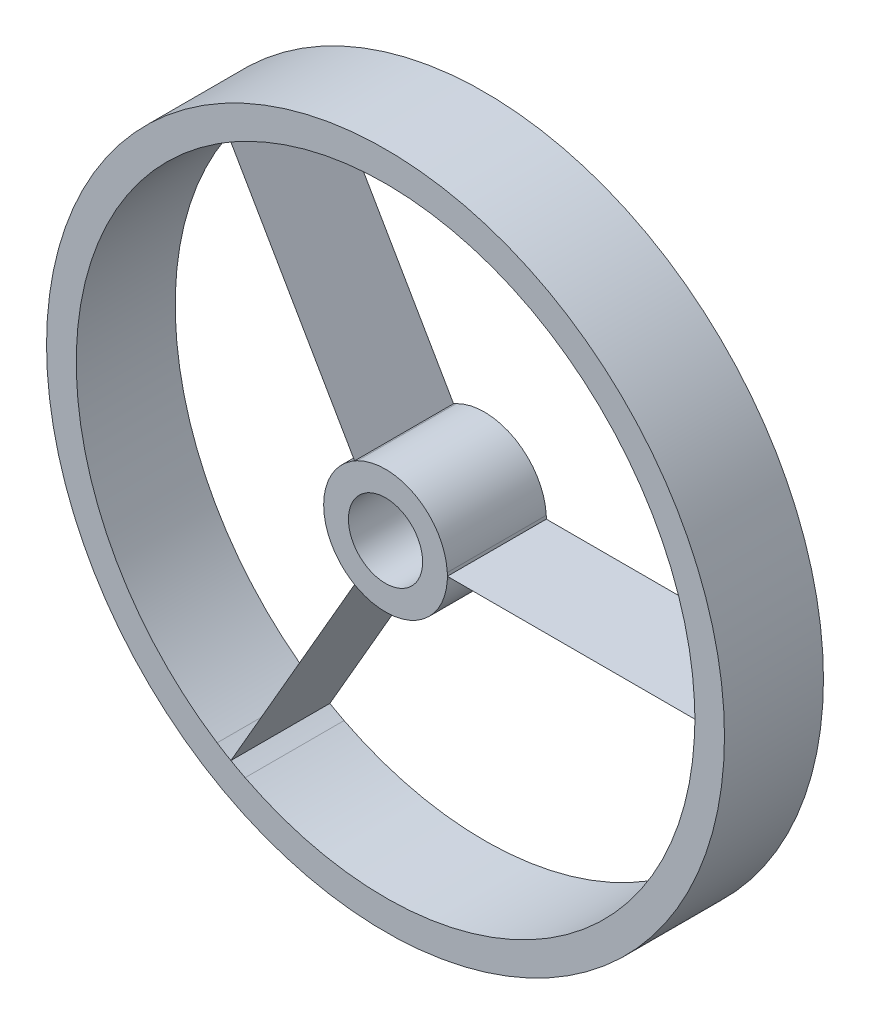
ISO-10303-21;
HEADER;
FILE_DESCRIPTION(('STEP AP214'),'2;1');
FILE_NAME('part.step','',(''),(''),'','','');
FILE_SCHEMA(('AUTOMOTIVE_DESIGN { 1 0 10303 214 1 1 1 1 }'));
ENDSEC;
DATA;
#1=APPLICATION_CONTEXT('core data for automotive mechanical design processes');
#2=APPLICATION_PROTOCOL_DEFINITION('international standard','automotive_design',2000,#1);
#3=PRODUCT_CONTEXT('',#1,'mechanical');
#4=PRODUCT('Part','Part','',(#3));
#5=PRODUCT_RELATED_PRODUCT_CATEGORY('part','',(#4));
#6=PRODUCT_DEFINITION_FORMATION('','',#4);
#7=PRODUCT_DEFINITION_CONTEXT('part definition',#1,'design');
#8=PRODUCT_DEFINITION('design','',#6,#7);
#9=PRODUCT_DEFINITION_SHAPE('','',#8);
#10=(LENGTH_UNIT() NAMED_UNIT(*) SI_UNIT(.MILLI.,.METRE.));
#11=(NAMED_UNIT(*) PLANE_ANGLE_UNIT() SI_UNIT($,.RADIAN.));
#12=(NAMED_UNIT(*) SI_UNIT($,.STERADIAN.) SOLID_ANGLE_UNIT());
#13=UNCERTAINTY_MEASURE_WITH_UNIT(LENGTH_MEASURE(1.E-05),#10,'distance_accuracy_value','');
#14=(GEOMETRIC_REPRESENTATION_CONTEXT(3) GLOBAL_UNCERTAINTY_ASSIGNED_CONTEXT((#13)) GLOBAL_UNIT_ASSIGNED_CONTEXT((#10,
#11,#12)) REPRESENTATION_CONTEXT('',''));
#15=CARTESIAN_POINT('',(0.,0.,0.));
#16=DIRECTION('',(0.,0.,1.));
#17=DIRECTION('',(1.,0.,0.));
#18=AXIS2_PLACEMENT_3D('',#15,#16,#17);
#19=CARTESIAN_POINT('',(-12.5000000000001,-21.6506350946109,40.));
#20=DIRECTION('',(0.866025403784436,-0.500000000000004,0.));
#21=DIRECTION('',(0.500000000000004,0.866025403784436,0.));
#22=AXIS2_PLACEMENT_3D('',#19,#20,#21);
#23=PLANE('',#22);
#24=DIRECTION('',(0.500000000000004,0.866025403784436,0.));
#25=VECTOR('',#24,1.);
#26=CARTESIAN_POINT('',(-12.5000000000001,-21.6506350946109,40.));
#27=LINE('',#26,#25);
#28=CARTESIAN_POINT('',(-62.5000000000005,-108.253175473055,40.));
#29=VERTEX_POINT('',#28);
#30=CARTESIAN_POINT('',(-12.5000000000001,-21.6506350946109,40.));
#31=VERTEX_POINT('',#30);
#32=EDGE_CURVE('E60',#29,#31,#27,.T.);
#33=ORIENTED_EDGE('',*,*,#32,.F.);
#34=DIRECTION('',(0.,0.,-1.));
#35=VECTOR('',#34,1.);
#36=CARTESIAN_POINT('',(-62.5000000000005,-108.253175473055,40.));
#37=LINE('',#36,#35);
#38=CARTESIAN_POINT('',(-62.5000000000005,-108.253175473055,0.));
#39=VERTEX_POINT('',#38);
#40=EDGE_CURVE('E13',#29,#39,#37,.T.);
#41=ORIENTED_EDGE('',*,*,#40,.T.);
#42=DIRECTION('',(0.500000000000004,0.866025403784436,0.));
#43=VECTOR('',#42,1.);
#44=CARTESIAN_POINT('',(-12.5000000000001,-21.6506350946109,0.));
#45=LINE('',#44,#43);
#46=CARTESIAN_POINT('',(-12.5000000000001,-21.6506350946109,0.));
#47=VERTEX_POINT('',#46);
#48=EDGE_CURVE('E75',#39,#47,#45,.T.);
#49=ORIENTED_EDGE('',*,*,#48,.T.);
#50=DIRECTION('',(0.,0.,1.));
#51=VECTOR('',#50,1.);
#52=CARTESIAN_POINT('',(-12.5000000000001,-21.6506350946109,40.));
#53=LINE('',#52,#51);
#54=EDGE_CURVE('E70',#47,#31,#53,.T.);
#55=ORIENTED_EDGE('',*,*,#54,.T.);
#56=EDGE_LOOP('',(#33,#41,#49,#55));
#57=FACE_BOUND('',#56,.T.);
#58=ADVANCED_FACE('F55',(#57),#23,.T.);
#59=OPEN_SHELL('',(#58));
#60=SHELL_BASED_SURFACE_MODEL('B2',(#59));
#61=CARTESIAN_POINT('',(25.,0.,40.));
#62=DIRECTION('',(0.,1.,0.));
#63=DIRECTION('',(0.,0.,1.));
#64=AXIS2_PLACEMENT_3D('',#61,#62,#63);
#65=PLANE('',#64);
#66=DIRECTION('',(0.,0.,1.));
#67=VECTOR('',#66,1.);
#68=CARTESIAN_POINT('',(25.,0.,40.));
#69=LINE('',#68,#67);
#70=CARTESIAN_POINT('',(25.,0.,0.));
#71=VERTEX_POINT('',#70);
#72=CARTESIAN_POINT('',(25.,0.,40.));
#73=VERTEX_POINT('',#72);
#74=EDGE_CURVE('E53',#71,#73,#69,.T.);
#75=ORIENTED_EDGE('',*,*,#74,.F.);
#76=DIRECTION('',(-1.,0.,0.));
#77=VECTOR('',#76,1.);
#78=CARTESIAN_POINT('',(25.,0.,0.));
#79=LINE('',#78,#77);
#80=CARTESIAN_POINT('',(125.,0.,0.));
#81=VERTEX_POINT('',#80);
#82=EDGE_CURVE('E139',#81,#71,#79,.T.);
#83=ORIENTED_EDGE('',*,*,#82,.F.);
#84=DIRECTION('',(0.,0.,-1.));
#85=VECTOR('',#84,1.);
#86=CARTESIAN_POINT('',(125.,0.,40.));
#87=LINE('',#86,#85);
#88=CARTESIAN_POINT('',(125.,0.,40.));
#89=VERTEX_POINT('',#88);
#90=EDGE_CURVE('E134',#89,#81,#87,.T.);
#91=ORIENTED_EDGE('',*,*,#90,.F.);
#92=DIRECTION('',(-1.,0.,0.));
#93=VECTOR('',#92,1.);
#94=CARTESIAN_POINT('',(25.,0.,40.));
#95=LINE('',#94,#93);
#96=EDGE_CURVE('E124',#89,#73,#95,.T.);
#97=ORIENTED_EDGE('',*,*,#96,.T.);
#98=EDGE_LOOP('',(#75,#83,#91,#97));
#99=FACE_BOUND('',#98,.T.);
#100=ADVANCED_FACE('F119',(#99),#65,.F.);
#101=OPEN_SHELL('',(#100));
#102=SHELL_BASED_SURFACE_MODEL('B7',(#101));
#103=CARTESIAN_POINT('',(-12.5000000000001,21.6506350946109,40.));
#104=DIRECTION('',(-0.866025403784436,-0.500000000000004,0.));
#105=DIRECTION('',(0.500000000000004,-0.866025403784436,0.));
#106=AXIS2_PLACEMENT_3D('',#103,#104,#105);
#107=PLANE('',#106);
#108=DIRECTION('',(0.,0.,1.));
#109=VECTOR('',#108,1.);
#110=CARTESIAN_POINT('',(-12.5000000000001,21.6506350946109,40.));
#111=LINE('',#110,#109);
#112=CARTESIAN_POINT('',(-12.5000000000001,21.6506350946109,0.));
#113=VERTEX_POINT('',#112);
#114=CARTESIAN_POINT('',(-12.5000000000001,21.6506350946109,40.));
#115=VERTEX_POINT('',#114);
#116=EDGE_CURVE('E117',#113,#115,#111,.T.);
#117=ORIENTED_EDGE('',*,*,#116,.F.);
#118=DIRECTION('',(0.500000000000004,-0.866025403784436,0.));
#119=VECTOR('',#118,1.);
#120=CARTESIAN_POINT('',(-12.5000000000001,21.6506350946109,0.));
#121=LINE('',#120,#119);
#122=CARTESIAN_POINT('',(-62.5000000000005,108.253175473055,0.));
#123=VERTEX_POINT('',#122);
#124=EDGE_CURVE('E203',#123,#113,#121,.T.);
#125=ORIENTED_EDGE('',*,*,#124,.F.);
#126=DIRECTION('',(0.,0.,-1.));
#127=VECTOR('',#126,1.);
#128=CARTESIAN_POINT('',(-62.5000000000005,108.253175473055,40.));
#129=LINE('',#128,#127);
#130=CARTESIAN_POINT('',(-62.5000000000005,108.253175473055,40.));
#131=VERTEX_POINT('',#130);
#132=EDGE_CURVE('E198',#131,#123,#129,.T.);
#133=ORIENTED_EDGE('',*,*,#132,.F.);
#134=DIRECTION('',(0.500000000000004,-0.866025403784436,0.));
#135=VECTOR('',#134,1.);
#136=CARTESIAN_POINT('',(-12.5000000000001,21.6506350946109,40.));
#137=LINE('',#136,#135);
#138=EDGE_CURVE('E188',#131,#115,#137,.T.);
#139=ORIENTED_EDGE('',*,*,#138,.T.);
#140=EDGE_LOOP('',(#117,#125,#133,#139));
#141=FACE_BOUND('',#140,.T.);
#142=ADVANCED_FACE('F183',(#141),#107,.F.);
#143=OPEN_SHELL('',(#142));
#144=SHELL_BASED_SURFACE_MODEL('B47',(#143));
#145=CARTESIAN_POINT('',(0.,0.,40.));
#146=DIRECTION('',(0.,0.,-1.));
#147=DIRECTION('',(-1.,0.,0.));
#148=AXIS2_PLACEMENT_3D('',#145,#146,#147);
#149=CYLINDRICAL_SURFACE('',#148,125.);
#150=CARTESIAN_POINT('',(0.,0.,0.));
#151=DIRECTION('',(0.,0.,1.));
#152=DIRECTION('',(1.,0.,0.));
#153=AXIS2_PLACEMENT_3D('',#150,#151,#152);
#154=CIRCLE('',#153,125.);
#155=CARTESIAN_POINT('',(-56.7488124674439,111.375815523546,0.));
#156=VERTEX_POINT('',#155);
#157=CARTESIAN_POINT('',(-68.0798793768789,104.833820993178,0.));
#158=VERTEX_POINT('',#157);
#159=EDGE_CURVE('E319',#156,#158,#154,.T.);
#160=ORIENTED_EDGE('',*,*,#159,.F.);
#161=DIRECTION('',(0.,0.,-1.));
#162=VECTOR('',#161,1.);
#163=CARTESIAN_POINT('',(-56.7488124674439,111.375815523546,40.));
#164=LINE('',#163,#162);
#165=CARTESIAN_POINT('',(-56.7488124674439,111.375815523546,40.));
#166=VERTEX_POINT('',#165);
#167=EDGE_CURVE('E181',#156,#166,#164,.F.);
#168=ORIENTED_EDGE('',*,*,#167,.T.);
#169=CARTESIAN_POINT('',(0.,0.,40.));
#170=DIRECTION('',(0.,0.,1.));
#171=DIRECTION('',(1.,0.,0.));
#172=AXIS2_PLACEMENT_3D('',#169,#170,#171);
#173=CIRCLE('',#172,125.);
#174=CARTESIAN_POINT('',(-68.0798793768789,104.833820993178,40.));
#175=VERTEX_POINT('',#174);
#176=EDGE_CURVE('E312',#166,#175,#173,.T.);
#177=ORIENTED_EDGE('',*,*,#176,.T.);
#178=DIRECTION('',(0.,0.,-1.));
#179=VECTOR('',#178,1.);
#180=CARTESIAN_POINT('',(-68.0798793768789,104.833820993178,40.));
#181=LINE('',#180,#179);
#182=EDGE_CURVE('E244',#175,#158,#181,.T.);
#183=ORIENTED_EDGE('',*,*,#182,.T.);
#184=EDGE_LOOP('',(#160,#168,#177,#183));
#185=FACE_BOUND('',#184,.T.);
#186=ADVANCED_FACE('F235',(#185),#149,.F.);
#187=ORIENTED_EDGE('',*,*,#167,.F.);
#188=CARTESIAN_POINT('',(124.828691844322,6.54199453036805,0.));
#189=VERTEX_POINT('',#188);
#190=EDGE_CURVE('E295',#189,#156,#154,.T.);
#191=ORIENTED_EDGE('',*,*,#190,.F.);
#192=DIRECTION('',(0.,0.,-1.));
#193=VECTOR('',#192,1.);
#194=CARTESIAN_POINT('',(124.828691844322,6.54199453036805,40.));
#195=LINE('',#194,#193);
#196=CARTESIAN_POINT('',(124.828691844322,6.54199453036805,40.));
#197=VERTEX_POINT('',#196);
#198=EDGE_CURVE('E289',#197,#189,#195,.T.);
#199=ORIENTED_EDGE('',*,*,#198,.F.);
#200=EDGE_CURVE('E293',#197,#166,#173,.T.);
#201=ORIENTED_EDGE('',*,*,#200,.T.);
#202=EDGE_LOOP('',(#187,#191,#199,#201));
#203=FACE_BOUND('',#202,.T.);
#204=ADVANCED_FACE('F291',(#203),#149,.F.);
#205=CARTESIAN_POINT('',(-68.0798793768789,-104.833820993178,0.));
#206=VERTEX_POINT('',#205);
#207=CARTESIAN_POINT('',(-56.7488124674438,-111.375815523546,0.));
#208=VERTEX_POINT('',#207);
#209=EDGE_CURVE('E343',#206,#208,#154,.T.);
#210=ORIENTED_EDGE('',*,*,#209,.F.);
#211=DIRECTION('',(0.,0.,-1.));
#212=VECTOR('',#211,1.);
#213=CARTESIAN_POINT('',(-68.0798793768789,-104.833820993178,40.));
#214=LINE('',#213,#212);
#215=CARTESIAN_POINT('',(-68.0798793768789,-104.833820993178,40.));
#216=VERTEX_POINT('',#215);
#217=EDGE_CURVE('E327',#206,#216,#214,.F.);
#218=ORIENTED_EDGE('',*,*,#217,.T.);
#219=CARTESIAN_POINT('',(-56.7488124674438,-111.375815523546,40.));
#220=VERTEX_POINT('',#219);
#221=EDGE_CURVE('E349',#216,#220,#173,.T.);
#222=ORIENTED_EDGE('',*,*,#221,.T.);
#223=DIRECTION('',(0.,0.,-1.));
#224=VECTOR('',#223,1.);
#225=CARTESIAN_POINT('',(-56.7488124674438,-111.375815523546,40.));
#226=LINE('',#225,#224);
#227=EDGE_CURVE('E259',#220,#208,#226,.T.);
#228=ORIENTED_EDGE('',*,*,#227,.T.);
#229=EDGE_LOOP('',(#210,#218,#222,#228));
#230=FACE_BOUND('',#229,.T.);
#231=ADVANCED_FACE('F347',(#230),#149,.F.);
#232=ORIENTED_EDGE('',*,*,#182,.F.);
#233=EDGE_CURVE('E316',#175,#216,#173,.T.);
#234=ORIENTED_EDGE('',*,*,#233,.T.);
#235=ORIENTED_EDGE('',*,*,#217,.F.);
#236=EDGE_CURVE('E339',#158,#206,#154,.T.);
#237=ORIENTED_EDGE('',*,*,#236,.F.);
#238=EDGE_LOOP('',(#232,#234,#235,#237));
#239=FACE_BOUND('',#238,.T.);
#240=ADVANCED_FACE('F340',(#239),#149,.F.);
#241=CARTESIAN_POINT('',(124.828691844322,-6.541994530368,0.));
#242=VERTEX_POINT('',#241);
#243=EDGE_CURVE('E320',#242,#189,#154,.T.);
#244=ORIENTED_EDGE('',*,*,#243,.F.);
#245=DIRECTION('',(0.,0.,-1.));
#246=VECTOR('',#245,1.);
#247=CARTESIAN_POINT('',(124.828691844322,-6.541994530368,40.));
#248=LINE('',#247,#246);
#249=CARTESIAN_POINT('',(124.828691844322,-6.541994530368,40.));
#250=VERTEX_POINT('',#249);
#251=EDGE_CURVE('E251',#242,#250,#248,.F.);
#252=ORIENTED_EDGE('',*,*,#251,.T.);
#253=EDGE_CURVE('E302',#250,#197,#173,.T.);
#254=ORIENTED_EDGE('',*,*,#253,.T.);
#255=ORIENTED_EDGE('',*,*,#198,.T.);
#256=EDGE_LOOP('',(#244,#252,#254,#255));
#257=FACE_BOUND('',#256,.T.);
#258=ADVANCED_FACE('F303',(#257),#149,.F.);
#259=CARTESIAN_POINT('',(0.,0.,40.));
#260=DIRECTION('',(0.,0.,1.));
#261=DIRECTION('',(1.,0.,0.));
#262=AXIS2_PLACEMENT_3D('',#259,#260,#261);
#263=PLANE('',#262);
#264=CARTESIAN_POINT('',(0.,0.,40.));
#265=DIRECTION('',(0.,0.,1.));
#266=DIRECTION('',(1.,0.,0.));
#267=AXIS2_PLACEMENT_3D('',#264,#265,#266);
#268=CIRCLE('',#267,137.);
#269=CARTESIAN_POINT('',(137.,0.,40.));
#270=VERTEX_POINT('',#269);
#271=EDGE_CURVE('E299',#270,#270,#268,.T.);
#272=ORIENTED_EDGE('',*,*,#271,.T.);
#273=EDGE_LOOP('',(#272));
#274=FACE_BOUND('',#273,.T.);
#275=ORIENTED_EDGE('',*,*,#200,.F.);
#276=ORIENTED_EDGE('',*,*,#253,.F.);
#277=EDGE_CURVE('E306',#220,#250,#173,.T.);
#278=ORIENTED_EDGE('',*,*,#277,.F.);
#279=ORIENTED_EDGE('',*,*,#221,.F.);
#280=ORIENTED_EDGE('',*,*,#233,.F.);
#281=ORIENTED_EDGE('',*,*,#176,.F.);
#282=EDGE_LOOP('',(#275,#276,#278,#279,#280,#281));
#283=FACE_BOUND('',#282,.T.);
#284=ADVANCED_FACE('F309',(#274,#283),#263,.T.);
#285=CARTESIAN_POINT('',(0.,0.,0.));
#286=DIRECTION('',(0.,0.,1.));
#287=DIRECTION('',(1.,0.,0.));
#288=AXIS2_PLACEMENT_3D('',#285,#286,#287);
#289=PLANE('',#288);
#290=CARTESIAN_POINT('',(0.,0.,0.));
#291=DIRECTION('',(0.,0.,1.));
#292=DIRECTION('',(1.,0.,0.));
#293=AXIS2_PLACEMENT_3D('',#290,#291,#292);
#294=CIRCLE('',#293,137.);
#295=CARTESIAN_POINT('',(137.,0.,0.));
#296=VERTEX_POINT('',#295);
#297=EDGE_CURVE('E313',#296,#296,#294,.T.);
#298=ORIENTED_EDGE('',*,*,#297,.F.);
#299=EDGE_LOOP('',(#298));
#300=FACE_BOUND('',#299,.T.);
#301=ORIENTED_EDGE('',*,*,#190,.T.);
#302=ORIENTED_EDGE('',*,*,#159,.T.);
#303=ORIENTED_EDGE('',*,*,#236,.T.);
#304=ORIENTED_EDGE('',*,*,#209,.T.);
#305=EDGE_CURVE('E346',#208,#242,#154,.T.);
#306=ORIENTED_EDGE('',*,*,#305,.T.);
#307=ORIENTED_EDGE('',*,*,#243,.T.);
#308=EDGE_LOOP('',(#301,#302,#303,#304,#306,#307));
#309=FACE_BOUND('',#308,.T.);
#310=ADVANCED_FACE('F344',(#300,#309),#289,.F.);
#311=CARTESIAN_POINT('',(0.,0.,40.));
#312=DIRECTION('',(0.,0.,-1.));
#313=DIRECTION('',(-1.,0.,0.));
#314=AXIS2_PLACEMENT_3D('',#311,#312,#313);
#315=CYLINDRICAL_SURFACE('',#314,137.);
#316=ORIENTED_EDGE('',*,*,#271,.F.);
#317=EDGE_LOOP('',(#316));
#318=FACE_BOUND('',#317,.T.);
#319=ORIENTED_EDGE('',*,*,#297,.T.);
#320=EDGE_LOOP('',(#319));
#321=FACE_BOUND('',#320,.T.);
#322=ADVANCED_FACE('F237',(#318,#321),#315,.T.);
#323=ORIENTED_EDGE('',*,*,#227,.F.);
#324=ORIENTED_EDGE('',*,*,#277,.T.);
#325=ORIENTED_EDGE('',*,*,#251,.F.);
#326=ORIENTED_EDGE('',*,*,#305,.F.);
#327=EDGE_LOOP('',(#323,#324,#325,#326));
#328=FACE_BOUND('',#327,.T.);
#329=ADVANCED_FACE('F350',(#328),#149,.F.);
#330=CLOSED_SHELL('',(#186,#204,#231,#240,#258,#284,#310,#322,#329));
#331=MANIFOLD_SOLID_BREP('B111',#330);
#332=CARTESIAN_POINT('',(0.,0.,40.));
#333=DIRECTION('',(0.,0.,-1.));
#334=DIRECTION('',(-1.,0.,0.));
#335=AXIS2_PLACEMENT_3D('',#332,#333,#334);
#336=CYLINDRICAL_SURFACE('',#335,25.);
#337=DIRECTION('',(0.,0.,-1.));
#338=VECTOR('',#337,1.);
#339=CARTESIAN_POINT('',(-11.3497624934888,22.2751631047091,40.));
#340=LINE('',#339,#338);
#341=CARTESIAN_POINT('',(-11.3497624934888,22.2751631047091,0.));
#342=VERTEX_POINT('',#341);
#343=CARTESIAN_POINT('',(-11.3497624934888,22.2751631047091,40.));
#344=VERTEX_POINT('',#343);
#345=EDGE_CURVE('E233',#342,#344,#340,.F.);
#346=ORIENTED_EDGE('',*,*,#345,.F.);
#347=CARTESIAN_POINT('',(0.,0.,0.));
#348=DIRECTION('',(0.,0.,1.));
#349=DIRECTION('',(1.,0.,0.));
#350=AXIS2_PLACEMENT_3D('',#347,#348,#349);
#351=CIRCLE('',#350,25.);
#352=CARTESIAN_POINT('',(-13.6159758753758,20.9667641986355,0.));
#353=VERTEX_POINT('',#352);
#354=EDGE_CURVE('E515',#342,#353,#351,.T.);
#355=ORIENTED_EDGE('',*,*,#354,.T.);
#356=DIRECTION('',(0.,0.,-1.));
#357=VECTOR('',#356,1.);
#358=CARTESIAN_POINT('',(-13.6159758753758,20.9667641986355,40.));
#359=LINE('',#358,#357);
#360=CARTESIAN_POINT('',(-13.6159758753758,20.9667641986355,40.));
#361=VERTEX_POINT('',#360);
#362=EDGE_CURVE('E443',#361,#353,#359,.T.);
#363=ORIENTED_EDGE('',*,*,#362,.F.);
#364=CARTESIAN_POINT('',(0.,0.,40.));
#365=DIRECTION('',(0.,0.,1.));
#366=DIRECTION('',(1.,0.,0.));
#367=AXIS2_PLACEMENT_3D('',#364,#365,#366);
#368=CIRCLE('',#367,25.);
#369=EDGE_CURVE('E509',#344,#361,#368,.T.);
#370=ORIENTED_EDGE('',*,*,#369,.F.);
#371=EDGE_LOOP('',(#346,#355,#363,#370));
#372=FACE_BOUND('',#371,.T.);
#373=ADVANCED_FACE('F434',(#372),#336,.T.);
#374=CARTESIAN_POINT('',(24.9657383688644,1.30839890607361,0.));
#375=VERTEX_POINT('',#374);
#376=EDGE_CURVE('E505',#375,#342,#351,.T.);
#377=ORIENTED_EDGE('',*,*,#376,.T.);
#378=ORIENTED_EDGE('',*,*,#345,.T.);
#379=CARTESIAN_POINT('',(24.9657383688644,1.30839890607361,40.));
#380=VERTEX_POINT('',#379);
#381=EDGE_CURVE('E497',#380,#344,#368,.T.);
#382=ORIENTED_EDGE('',*,*,#381,.F.);
#383=DIRECTION('',(0.,0.,-1.));
#384=VECTOR('',#383,1.);
#385=CARTESIAN_POINT('',(24.9657383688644,1.30839890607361,40.));
#386=LINE('',#385,#384);
#387=EDGE_CURVE('E486',#380,#375,#386,.T.);
#388=ORIENTED_EDGE('',*,*,#387,.T.);
#389=EDGE_LOOP('',(#377,#378,#382,#388));
#390=FACE_BOUND('',#389,.T.);
#391=ADVANCED_FACE('F507',(#390),#336,.T.);
#392=DIRECTION('',(0.,0.,-1.));
#393=VECTOR('',#392,1.);
#394=CARTESIAN_POINT('',(-13.6159758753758,-20.9667641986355,40.));
#395=LINE('',#394,#393);
#396=CARTESIAN_POINT('',(-13.6159758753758,-20.9667641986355,0.));
#397=VERTEX_POINT('',#396);
#398=CARTESIAN_POINT('',(-13.6159758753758,-20.9667641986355,40.));
#399=VERTEX_POINT('',#398);
#400=EDGE_CURVE('E521',#397,#399,#395,.F.);
#401=ORIENTED_EDGE('',*,*,#400,.F.);
#402=CARTESIAN_POINT('',(-11.3497624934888,-22.2751631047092,0.));
#403=VERTEX_POINT('',#402);
#404=EDGE_CURVE('E540',#397,#403,#351,.T.);
#405=ORIENTED_EDGE('',*,*,#404,.T.);
#406=DIRECTION('',(0.,0.,-1.));
#407=VECTOR('',#406,1.);
#408=CARTESIAN_POINT('',(-11.3497624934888,-22.2751631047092,40.));
#409=LINE('',#408,#407);
#410=CARTESIAN_POINT('',(-11.3497624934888,-22.2751631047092,40.));
#411=VERTEX_POINT('',#410);
#412=EDGE_CURVE('E458',#411,#403,#409,.T.);
#413=ORIENTED_EDGE('',*,*,#412,.F.);
#414=EDGE_CURVE('E542',#399,#411,#368,.T.);
#415=ORIENTED_EDGE('',*,*,#414,.F.);
#416=EDGE_LOOP('',(#401,#405,#413,#415));
#417=FACE_BOUND('',#416,.T.);
#418=ADVANCED_FACE('F544',(#417),#336,.T.);
#419=EDGE_CURVE('E510',#361,#399,#368,.T.);
#420=ORIENTED_EDGE('',*,*,#419,.F.);
#421=ORIENTED_EDGE('',*,*,#362,.T.);
#422=EDGE_CURVE('E531',#353,#397,#351,.T.);
#423=ORIENTED_EDGE('',*,*,#422,.T.);
#424=ORIENTED_EDGE('',*,*,#400,.T.);
#425=EDGE_LOOP('',(#420,#421,#423,#424));
#426=FACE_BOUND('',#425,.T.);
#427=ADVANCED_FACE('F530',(#426),#336,.T.);
#428=DIRECTION('',(0.,0.,-1.));
#429=VECTOR('',#428,1.);
#430=CARTESIAN_POINT('',(24.9657383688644,-1.3083989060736,40.));
#431=LINE('',#430,#429);
#432=CARTESIAN_POINT('',(24.9657383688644,-1.3083989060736,0.));
#433=VERTEX_POINT('',#432);
#434=CARTESIAN_POINT('',(24.9657383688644,-1.3083989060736,40.));
#435=VERTEX_POINT('',#434);
#436=EDGE_CURVE('E450',#433,#435,#431,.F.);
#437=ORIENTED_EDGE('',*,*,#436,.F.);
#438=EDGE_CURVE('E491',#433,#375,#351,.T.);
#439=ORIENTED_EDGE('',*,*,#438,.T.);
#440=ORIENTED_EDGE('',*,*,#387,.F.);
#441=EDGE_CURVE('E489',#435,#380,#368,.T.);
#442=ORIENTED_EDGE('',*,*,#441,.F.);
#443=EDGE_LOOP('',(#437,#439,#440,#442));
#444=FACE_BOUND('',#443,.T.);
#445=ADVANCED_FACE('F488',(#444),#336,.T.);
#446=EDGE_CURVE('E504',#411,#435,#368,.T.);
#447=ORIENTED_EDGE('',*,*,#446,.F.);
#448=ORIENTED_EDGE('',*,*,#412,.T.);
#449=EDGE_CURVE('E545',#403,#433,#351,.T.);
#450=ORIENTED_EDGE('',*,*,#449,.T.);
#451=ORIENTED_EDGE('',*,*,#436,.T.);
#452=EDGE_LOOP('',(#447,#448,#450,#451));
#453=FACE_BOUND('',#452,.T.);
#454=ADVANCED_FACE('F436',(#453),#336,.T.);
#455=CARTESIAN_POINT('',(0.,0.,40.));
#456=DIRECTION('',(0.,0.,1.));
#457=DIRECTION('',(1.,0.,0.));
#458=AXIS2_PLACEMENT_3D('',#455,#456,#457);
#459=PLANE('',#458);
#460=CARTESIAN_POINT('',(0.,0.,40.));
#461=DIRECTION('',(0.,0.,1.));
#462=DIRECTION('',(1.,0.,0.));
#463=AXIS2_PLACEMENT_3D('',#460,#461,#462);
#464=CIRCLE('',#463,15.);
#465=CARTESIAN_POINT('',(15.,0.,40.));
#466=VERTEX_POINT('',#465);
#467=EDGE_CURVE('E513',#466,#466,#464,.T.);
#468=ORIENTED_EDGE('',*,*,#467,.F.);
#469=EDGE_LOOP('',(#468));
#470=FACE_BOUND('',#469,.T.);
#471=ORIENTED_EDGE('',*,*,#381,.T.);
#472=ORIENTED_EDGE('',*,*,#369,.T.);
#473=ORIENTED_EDGE('',*,*,#419,.T.);
#474=ORIENTED_EDGE('',*,*,#414,.T.);
#475=ORIENTED_EDGE('',*,*,#446,.T.);
#476=ORIENTED_EDGE('',*,*,#441,.T.);
#477=EDGE_LOOP('',(#471,#472,#473,#474,#475,#476));
#478=FACE_BOUND('',#477,.T.);
#479=ADVANCED_FACE('F501',(#470,#478),#459,.T.);
#480=CARTESIAN_POINT('',(0.,0.,0.));
#481=DIRECTION('',(0.,0.,1.));
#482=DIRECTION('',(1.,0.,0.));
#483=AXIS2_PLACEMENT_3D('',#480,#481,#482);
#484=PLANE('',#483);
#485=CARTESIAN_POINT('',(0.,0.,0.));
#486=DIRECTION('',(0.,0.,1.));
#487=DIRECTION('',(1.,0.,0.));
#488=AXIS2_PLACEMENT_3D('',#485,#486,#487);
#489=CIRCLE('',#488,15.);
#490=CARTESIAN_POINT('',(15.,0.,0.));
#491=VERTEX_POINT('',#490);
#492=EDGE_CURVE('E546',#491,#491,#489,.T.);
#493=ORIENTED_EDGE('',*,*,#492,.T.);
#494=EDGE_LOOP('',(#493));
#495=FACE_BOUND('',#494,.T.);
#496=ORIENTED_EDGE('',*,*,#376,.F.);
#497=ORIENTED_EDGE('',*,*,#438,.F.);
#498=ORIENTED_EDGE('',*,*,#449,.F.);
#499=ORIENTED_EDGE('',*,*,#404,.F.);
#500=ORIENTED_EDGE('',*,*,#422,.F.);
#501=ORIENTED_EDGE('',*,*,#354,.F.);
#502=EDGE_LOOP('',(#496,#497,#498,#499,#500,#501));
#503=FACE_BOUND('',#502,.T.);
#504=ADVANCED_FACE('F538',(#495,#503),#484,.F.);
#505=CARTESIAN_POINT('',(0.,0.,0.));
#506=DIRECTION('',(0.,0.,1.));
#507=DIRECTION('',(1.,0.,0.));
#508=AXIS2_PLACEMENT_3D('',#505,#506,#507);
#509=CYLINDRICAL_SURFACE('',#508,15.);
#510=ORIENTED_EDGE('',*,*,#492,.F.);
#511=EDGE_LOOP('',(#510));
#512=FACE_BOUND('',#511,.T.);
#513=ORIENTED_EDGE('',*,*,#467,.T.);
#514=EDGE_LOOP('',(#513));
#515=FACE_BOUND('',#514,.T.);
#516=ADVANCED_FACE('F553',(#512,#515),#509,.F.);
#517=CLOSED_SHELL('',(#373,#391,#418,#427,#445,#454,#479,#504,#516));
#518=MANIFOLD_SOLID_BREP('B175',#517);
#519=ADVANCED_BREP_SHAPE_REPRESENTATION('',(#18,#331,#518),#14);
#520=MANIFOLD_SURFACE_SHAPE_REPRESENTATION('',(#18,#60,#102,#144),#14);
#521=SHAPE_REPRESENTATION('',(#18),#14);
#522=SHAPE_DEFINITION_REPRESENTATION(#9,#521);
#523=SHAPE_REPRESENTATION_RELATIONSHIP('','',#521,#519);
#524=SHAPE_REPRESENTATION_RELATIONSHIP('','',#521,#520);
ENDSEC;
END-ISO-10303-21;
